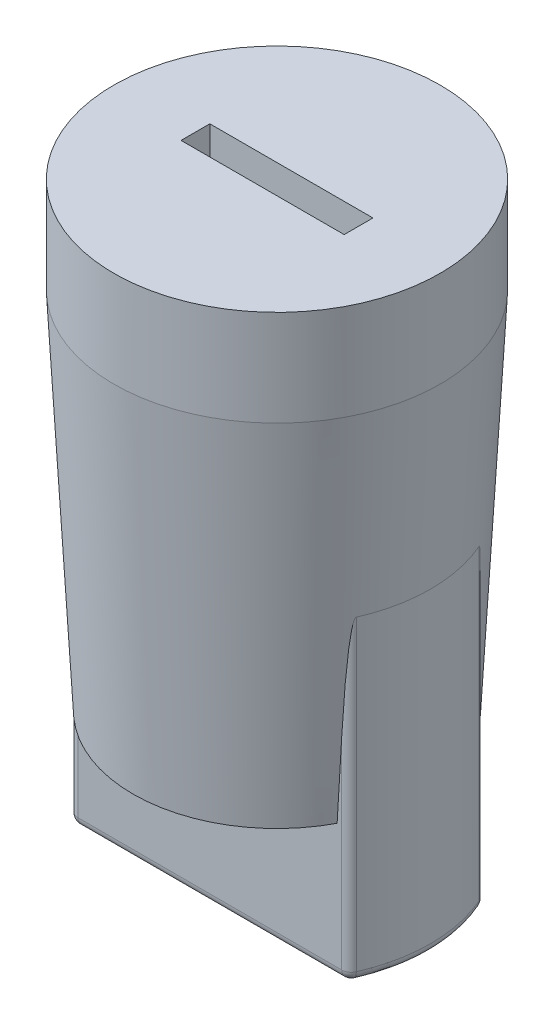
ISO-10303-21;
HEADER;
FILE_DESCRIPTION(('STEP AP214'),'2;1');
FILE_NAME('part.step','',(''),(''),'','','');
FILE_SCHEMA(('AUTOMOTIVE_DESIGN { 1 0 10303 214 1 1 1 1 }'));
ENDSEC;
DATA;
#1=APPLICATION_CONTEXT('core data for automotive mechanical design processes');
#2=APPLICATION_PROTOCOL_DEFINITION('international standard','automotive_design',2000,#1);
#3=PRODUCT_CONTEXT('',#1,'mechanical');
#4=PRODUCT('Part','Part','',(#3));
#5=PRODUCT_RELATED_PRODUCT_CATEGORY('part','',(#4));
#6=PRODUCT_DEFINITION_FORMATION('','',#4);
#7=PRODUCT_DEFINITION_CONTEXT('part definition',#1,'design');
#8=PRODUCT_DEFINITION('design','',#6,#7);
#9=PRODUCT_DEFINITION_SHAPE('','',#8);
#10=(LENGTH_UNIT() NAMED_UNIT(*) SI_UNIT(.MILLI.,.METRE.));
#11=(NAMED_UNIT(*) PLANE_ANGLE_UNIT() SI_UNIT($,.RADIAN.));
#12=(NAMED_UNIT(*) SI_UNIT($,.STERADIAN.) SOLID_ANGLE_UNIT());
#13=UNCERTAINTY_MEASURE_WITH_UNIT(LENGTH_MEASURE(1.E-05),#10,'distance_accuracy_value','');
#14=(GEOMETRIC_REPRESENTATION_CONTEXT(3) GLOBAL_UNCERTAINTY_ASSIGNED_CONTEXT((#13)) GLOBAL_UNIT_ASSIGNED_CONTEXT((#10,
#11,#12)) REPRESENTATION_CONTEXT('',''));
#15=CARTESIAN_POINT('',(0.,0.,0.));
#16=DIRECTION('',(0.,0.,1.));
#17=DIRECTION('',(1.,0.,0.));
#18=AXIS2_PLACEMENT_3D('',#15,#16,#17);
#19=CARTESIAN_POINT('',(7.5,0.,0.));
#20=DIRECTION('',(0.,-1.,0.));
#21=DIRECTION('',(0.,0.,-1.));
#22=AXIS2_PLACEMENT_3D('',#19,#20,#21);
#23=PLANE('',#22);
#24=DIRECTION('',(1.,0.,0.));
#25=VECTOR('',#24,1.);
#26=CARTESIAN_POINT('',(-7.19374728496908,0.,3.5));
#27=LINE('',#26,#25);
#28=CARTESIAN_POINT('',(-6.6332495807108,0.,3.5));
#29=VERTEX_POINT('',#28);
#30=CARTESIAN_POINT('',(6.6332495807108,0.,3.5));
#31=VERTEX_POINT('',#30);
#32=EDGE_CURVE('E251',#29,#31,#27,.T.);
#33=ORIENTED_EDGE('',*,*,#32,.T.);
#34=CARTESIAN_POINT('',(0.,0.,0.));
#35=DIRECTION('',(0.,-1.,0.));
#36=DIRECTION('',(0.,0.,-1.));
#37=AXIS2_PLACEMENT_3D('',#34,#35,#36);
#38=CIRCLE('',#37,7.5);
#39=EDGE_CURVE('E327',#31,#29,#38,.T.);
#40=ORIENTED_EDGE('',*,*,#39,.T.);
#41=EDGE_LOOP('',(#33,#40));
#42=FACE_BOUND('',#41,.T.);
#43=ADVANCED_FACE('F32',(#42),#23,.T.);
#44=CARTESIAN_POINT('',(0.,24.,0.));
#45=DIRECTION('',(0.,1.,0.));
#46=DIRECTION('',(0.,0.,1.));
#47=AXIS2_PLACEMENT_3D('',#44,#45,#46);
#48=PLANE('',#47);
#49=DIRECTION('',(-1.,0.,0.));
#50=VECTOR('',#49,1.);
#51=CARTESIAN_POINT('',(4.25,24.,0.750000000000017));
#52=LINE('',#51,#50);
#53=CARTESIAN_POINT('',(4.25,24.,0.750000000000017));
#54=VERTEX_POINT('',#53);
#55=CARTESIAN_POINT('',(-4.25000000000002,24.,0.750000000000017));
#56=VERTEX_POINT('',#55);
#57=EDGE_CURVE('E169',#54,#56,#52,.T.);
#58=ORIENTED_EDGE('',*,*,#57,.T.);
#59=DIRECTION('',(0.,0.,-1.));
#60=VECTOR('',#59,1.);
#61=CARTESIAN_POINT('',(-4.25000000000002,24.,0.750000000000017));
#62=LINE('',#61,#60);
#63=CARTESIAN_POINT('',(-4.25000000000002,24.,-0.749999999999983));
#64=VERTEX_POINT('',#63);
#65=EDGE_CURVE('E175',#56,#64,#62,.T.);
#66=ORIENTED_EDGE('',*,*,#65,.T.);
#67=DIRECTION('',(1.,0.,0.));
#68=VECTOR('',#67,1.);
#69=CARTESIAN_POINT('',(-4.25000000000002,24.,-0.749999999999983));
#70=LINE('',#69,#68);
#71=CARTESIAN_POINT('',(4.25,24.,-0.749999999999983));
#72=VERTEX_POINT('',#71);
#73=EDGE_CURVE('E52',#64,#72,#70,.T.);
#74=ORIENTED_EDGE('',*,*,#73,.T.);
#75=DIRECTION('',(0.,0.,1.));
#76=VECTOR('',#75,1.);
#77=CARTESIAN_POINT('',(4.25,24.,-0.749999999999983));
#78=LINE('',#77,#76);
#79=EDGE_CURVE('E178',#72,#54,#78,.T.);
#80=ORIENTED_EDGE('',*,*,#79,.T.);
#81=EDGE_LOOP('',(#58,#66,#74,#80));
#82=FACE_BOUND('',#81,.T.);
#83=CARTESIAN_POINT('',(0.,24.,0.));
#84=DIRECTION('',(0.,-1.,0.));
#85=DIRECTION('',(0.,0.,-1.));
#86=AXIS2_PLACEMENT_3D('',#83,#84,#85);
#87=CIRCLE('',#86,8.5);
#88=CARTESIAN_POINT('',(0.,24.,-8.5));
#89=VERTEX_POINT('',#88);
#90=EDGE_CURVE('E387',#89,#89,#87,.T.);
#91=ORIENTED_EDGE('',*,*,#90,.F.);
#92=EDGE_LOOP('',(#91));
#93=FACE_BOUND('',#92,.T.);
#94=ADVANCED_FACE('F34',(#82,#93),#48,.T.);
#95=CARTESIAN_POINT('',(0.,0.,0.));
#96=DIRECTION('',(0.,-1.,0.));
#97=DIRECTION('',(0.,0.,-1.));
#98=AXIS2_PLACEMENT_3D('',#95,#96,#97);
#99=CYLINDRICAL_SURFACE('',#98,8.5);
#100=ORIENTED_EDGE('',*,*,#90,.T.);
#101=EDGE_LOOP('',(#100));
#102=FACE_BOUND('',#101,.T.);
#103=CARTESIAN_POINT('',(0.,19.,0.));
#104=DIRECTION('',(0.,-1.,0.));
#105=DIRECTION('',(0.,0.,-1.));
#106=AXIS2_PLACEMENT_3D('',#103,#104,#105);
#107=CIRCLE('',#106,8.5);
#108=CARTESIAN_POINT('',(0.,19.,-8.5));
#109=VERTEX_POINT('',#108);
#110=EDGE_CURVE('E333',#109,#109,#107,.T.);
#111=ORIENTED_EDGE('',*,*,#110,.F.);
#112=EDGE_LOOP('',(#111));
#113=FACE_BOUND('',#112,.T.);
#114=ADVANCED_FACE('F280',(#102,#113),#99,.T.);
#115=CARTESIAN_POINT('',(0.,0.,0.));
#116=DIRECTION('',(0.,1.,0.));
#117=DIRECTION('',(0.,0.,1.));
#118=AXIS2_PLACEMENT_3D('',#115,#116,#117);
#119=CONICAL_SURFACE('',#118,7.5,0.0525830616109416);
#120=CARTESIAN_POINT('',(0.,9.5,0.));
#121=DIRECTION('',(0.,1.,0.));
#122=DIRECTION('',(0.,0.,1.));
#123=AXIS2_PLACEMENT_3D('',#120,#121,#122);
#124=CIRCLE('',#123,8.);
#125=CARTESIAN_POINT('',(-7.33212111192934,9.5,-3.2));
#126=VERTEX_POINT('',#125);
#127=CARTESIAN_POINT('',(-7.33212111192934,9.5,3.2));
#128=VERTEX_POINT('',#127);
#129=EDGE_CURVE('E231',#126,#128,#124,.T.);
#130=ORIENTED_EDGE('',*,*,#129,.T.);
#131=CARTESIAN_POINT('',(-7.33212111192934,9.5,3.2));
#132=CARTESIAN_POINT('',(-7.33141494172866,9.50000549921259,3.20161881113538));
#133=CARTESIAN_POINT('',(-7.33070275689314,9.49983355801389,3.20322649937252));
#134=CARTESIAN_POINT('',(-7.32929504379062,9.49918730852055,3.20636127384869));
#135=CARTESIAN_POINT('',(-7.32859942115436,9.49871719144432,3.20788916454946));
#136=CARTESIAN_POINT('',(-7.32701916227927,9.4973378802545,3.21131640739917));
#137=CARTESIAN_POINT('',(-7.32614353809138,9.49633729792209,3.21318228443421));
#138=CARTESIAN_POINT('',(-7.32444600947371,9.49402446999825,3.21674721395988));
#139=CARTESIAN_POINT('',(-7.32362447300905,9.49271032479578,3.21844515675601));
#140=CARTESIAN_POINT('',(-7.32136810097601,9.48867610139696,3.22304898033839));
#141=CARTESIAN_POINT('',(-7.32000083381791,9.48570551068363,3.22576489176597));
#142=CARTESIAN_POINT('',(-7.31741813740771,9.47939170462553,3.23079654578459));
#143=CARTESIAN_POINT('',(-7.31620310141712,9.47604756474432,3.23311125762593));
#144=CARTESIAN_POINT('',(-7.31009974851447,9.45801873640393,3.24456589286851));
#145=CARTESIAN_POINT('',(-7.30607629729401,9.44172398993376,3.2514985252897));
#146=CARTESIAN_POINT('',(-7.29868418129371,9.40840672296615,3.26376217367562));
#147=CARTESIAN_POINT('',(-7.29532275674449,9.39137839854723,3.26907579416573));
#148=CARTESIAN_POINT('',(-7.28593885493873,9.34038774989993,3.28342636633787));
#149=CARTESIAN_POINT('',(-7.28047295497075,9.30591738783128,3.29111797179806));
#150=CARTESIAN_POINT('',(-7.27020298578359,9.23656170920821,3.30492993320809));
#151=CARTESIAN_POINT('',(-7.26540036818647,9.2016756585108,3.31104686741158));
#152=CARTESIAN_POINT('',(-7.25625096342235,9.13184371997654,3.32223130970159));
#153=CARTESIAN_POINT('',(-7.25190205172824,9.09689896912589,3.32730382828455));
#154=CARTESIAN_POINT('',(-7.24350118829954,9.02692269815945,3.33675969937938));
#155=CARTESIAN_POINT('',(-7.2394489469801,8.99189129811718,3.34114372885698));
#156=CARTESIAN_POINT('',(-7.22764698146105,8.88694655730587,3.35350897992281));
#157=CARTESIAN_POINT('',(-7.22021768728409,8.81690879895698,3.36074366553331));
#158=CARTESIAN_POINT('',(-7.2059036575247,8.67665758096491,3.37395438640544));
#159=CARTESIAN_POINT('',(-7.19901898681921,8.60644410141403,3.37993027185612));
#160=CARTESIAN_POINT('',(-7.1789382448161,8.39555102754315,3.39652969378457));
#161=CARTESIAN_POINT('',(-7.16632529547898,8.25471122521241,3.40581534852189));
#162=CARTESIAN_POINT('',(-7.14202428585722,7.97255436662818,3.42225614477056));
#163=CARTESIAN_POINT('',(-7.13033811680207,7.83123691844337,3.42940700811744));
#164=CARTESIAN_POINT('',(-7.107659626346,7.54852218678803,3.44216323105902));
#165=CARTESIAN_POINT('',(-7.09666708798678,7.40712494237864,3.44776907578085));
#166=CARTESIAN_POINT('',(-7.06562861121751,6.99801511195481,3.46231226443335));
#167=CARTESIAN_POINT('',(-7.04625887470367,6.73019916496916,3.46975748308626));
#168=CARTESIAN_POINT('',(-7.00882075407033,6.1943729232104,3.48183823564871));
#169=CARTESIAN_POINT('',(-6.99075259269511,5.92636260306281,3.48647328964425));
#170=CARTESIAN_POINT('',(-6.95573504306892,5.39177296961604,3.49357478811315));
#171=CARTESIAN_POINT('',(-6.93877987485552,5.12519418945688,3.49605341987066));
#172=CARTESIAN_POINT('',(-6.90572266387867,4.59203663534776,3.49925282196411));
#173=CARTESIAN_POINT('',(-6.88962041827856,4.32545787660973,3.49997401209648));
#174=CARTESIAN_POINT('',(-6.87386354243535,4.05886189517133,3.5));
#175=B_SPLINE_CURVE_WITH_KNOTS('',3,(#131,#132,#133,#134,#135,#136,#137,#138,#139,#140,#141,
#142,#143,#144,#145,#146,#147,#148,#149,#150,#151,#152,#153,#154,#155,#156,#157,#158,#159,#160,
#161,#162,#163,#164,#165,#166,#167,#168,#169,#170,#171,#172,#173,#174),.UNSPECIFIED.,.F.,.F.,(4,
2,2,2,2,2,2,2,2,2,2,2,2,2,2,2,2,2,2,2,2,4),(0.,0.00527748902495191,0.0104823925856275,
0.0173169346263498,0.024193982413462,0.0368751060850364,0.0495883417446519,0.103526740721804,
0.158025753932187,0.265034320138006,0.372273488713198,0.478985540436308,0.585592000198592,
0.797968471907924,1.01037020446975,1.4354539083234,1.86138385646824,2.28717991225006,
3.09300645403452,3.89897057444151,4.70034953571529,5.50153705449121),.UNSPECIFIED.);
#176=CARTESIAN_POINT('',(-6.87386354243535,4.05886189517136,3.5));
#177=VERTEX_POINT('',#176);
#178=EDGE_CURVE('E285',#128,#177,#175,.T.);
#179=ORIENTED_EDGE('',*,*,#178,.T.);
#180=CARTESIAN_POINT('',(-5.89967308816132,-12.1647881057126,3.5));
#181=CARTESIAN_POINT('',(-6.04705887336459,-9.75597407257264,3.5));
#182=CARTESIAN_POINT('',(-6.19306293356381,-7.34707598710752,3.5));
#183=CARTESIAN_POINT('',(-6.48274733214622,-2.52914120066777,3.5));
#184=CARTESIAN_POINT('',(-6.62642767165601,-0.120104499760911,3.5));
#185=CARTESIAN_POINT('',(-6.91190447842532,4.698080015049,3.5));
#186=CARTESIAN_POINT('',(-7.05370094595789,7.1072278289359,3.5));
#187=CARTESIAN_POINT('',(-7.33571599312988,11.9256165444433,3.5));
#188=CARTESIAN_POINT('',(-7.47593457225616,14.3348574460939,3.5));
#189=CARTESIAN_POINT('',(-7.83341477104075,20.5063672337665,3.5));
#190=CARTESIAN_POINT('',(-8.04972292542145,24.2686913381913,3.5));
#191=CARTESIAN_POINT('',(-8.47981142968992,31.7934843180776,3.5));
#192=CARTESIAN_POINT('',(-8.69359177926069,35.5559531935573,3.5));
#193=CARTESIAN_POINT('',(-9.11913312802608,43.0810001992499,3.5));
#194=CARTESIAN_POINT('',(-9.33089412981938,46.843578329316,3.5));
#195=CARTESIAN_POINT('',(-9.75275478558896,54.3688266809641,3.5));
#196=CARTESIAN_POINT('',(-9.96285444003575,58.1314969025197,3.5));
#197=CARTESIAN_POINT('',(-10.1723023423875,61.8942032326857,3.5));
#198=B_SPLINE_CURVE_WITH_KNOTS('',3,(#180,#181,#182,#183,#184,#185,#186,#187,#188,#189,#190,
#191,#192,#193,#194,#195,#196,#197),.UNSPECIFIED.,.F.,.F.,(4,2,2,2,2,2,2,2,4),(0.,
7.2399552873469,14.4799070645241,21.7198577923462,28.9598108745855,40.2654209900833,
51.5710325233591,62.8766295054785,74.1822232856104),.UNSPECIFIED.);
#199=EDGE_CURVE('E259',#177,#29,#198,.F.);
#200=ORIENTED_EDGE('',*,*,#199,.T.);
#201=ORIENTED_EDGE('',*,*,#39,.F.);
#202=CARTESIAN_POINT('',(5.89967308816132,-12.1647881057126,3.5));
#203=CARTESIAN_POINT('',(6.04705887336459,-9.75597407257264,3.5));
#204=CARTESIAN_POINT('',(6.19306293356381,-7.34707598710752,3.5));
#205=CARTESIAN_POINT('',(6.48274733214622,-2.52914120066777,3.5));
#206=CARTESIAN_POINT('',(6.62642767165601,-0.120104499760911,3.5));
#207=CARTESIAN_POINT('',(6.91190447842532,4.698080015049,3.5));
#208=CARTESIAN_POINT('',(7.05370094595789,7.1072278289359,3.5));
#209=CARTESIAN_POINT('',(7.33571599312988,11.9256165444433,3.5));
#210=CARTESIAN_POINT('',(7.47593457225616,14.3348574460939,3.5));
#211=CARTESIAN_POINT('',(7.83341477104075,20.5063672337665,3.5));
#212=CARTESIAN_POINT('',(8.04972292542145,24.2686913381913,3.5));
#213=CARTESIAN_POINT('',(8.47981142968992,31.7934843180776,3.5));
#214=CARTESIAN_POINT('',(8.69359177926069,35.5559531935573,3.5));
#215=CARTESIAN_POINT('',(9.11913312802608,43.0810001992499,3.5));
#216=CARTESIAN_POINT('',(9.33089412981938,46.843578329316,3.5));
#217=CARTESIAN_POINT('',(9.75275478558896,54.3688266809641,3.5));
#218=CARTESIAN_POINT('',(9.96285444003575,58.1314969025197,3.5));
#219=CARTESIAN_POINT('',(10.1723023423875,61.8942032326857,3.5));
#220=B_SPLINE_CURVE_WITH_KNOTS('',3,(#202,#203,#204,#205,#206,#207,#208,#209,#210,#211,#212,
#213,#214,#215,#216,#217,#218,#219),.UNSPECIFIED.,.F.,.F.,(4,2,2,2,2,2,2,2,4),(0.,
7.2399552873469,14.4799070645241,21.7198577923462,28.9598108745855,40.2654209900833,
51.5710325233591,62.8766295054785,74.1822232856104),.UNSPECIFIED.);
#221=CARTESIAN_POINT('',(6.87386354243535,4.05886189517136,3.5));
#222=VERTEX_POINT('',#221);
#223=EDGE_CURVE('E253',#31,#222,#220,.T.);
#224=ORIENTED_EDGE('',*,*,#223,.T.);
#225=CARTESIAN_POINT('',(6.87386354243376,4.05886189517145,3.5));
#226=CARTESIAN_POINT('',(6.87877214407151,4.14197119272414,3.49999989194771));
#227=CARTESIAN_POINT('',(6.88371624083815,4.22507839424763,3.49992773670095));
#228=CARTESIAN_POINT('',(6.89367910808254,4.39129727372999,3.49963206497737));
#229=CARTESIAN_POINT('',(6.89869788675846,4.47440895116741,3.4994085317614));
#230=CARTESIAN_POINT('',(6.9088218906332,4.64077782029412,3.49880228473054));
#231=CARTESIAN_POINT('',(6.91392725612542,4.7240350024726,3.49841928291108));
#232=CARTESIAN_POINT('',(6.9242191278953,4.89053424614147,3.49748450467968));
#233=CARTESIAN_POINT('',(6.92940562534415,4.97377630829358,3.4969327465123));
#234=CARTESIAN_POINT('',(6.95557940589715,5.3904423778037,3.49373116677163));
#235=CARTESIAN_POINT('',(6.9772036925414,5.72381997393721,3.4897598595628));
#236=CARTESIAN_POINT('',(7.01097481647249,6.22386360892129,3.48097239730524));
#237=CARTESIAN_POINT('',(7.02245859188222,6.39059981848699,3.47756979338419));
#238=CARTESIAN_POINT('',(7.04595665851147,6.72399254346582,3.46961503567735));
#239=CARTESIAN_POINT('',(7.05797090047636,6.89064906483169,3.46506298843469));
#240=CARTESIAN_POINT('',(7.08262401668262,7.22343617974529,3.45453195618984));
#241=CARTESIAN_POINT('',(7.09526118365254,7.38956701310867,3.4485567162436));
#242=CARTESIAN_POINT('',(7.12140708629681,7.72173534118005,3.43467267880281));
#243=CARTESIAN_POINT('',(7.13491611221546,7.88777278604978,3.42676323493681));
#244=CARTESIAN_POINT('',(7.16314470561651,8.21937710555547,3.40818152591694));
#245=CARTESIAN_POINT('',(7.17786258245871,8.38494431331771,3.39751307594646));
#246=CARTESIAN_POINT('',(7.20156491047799,8.63280034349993,3.37777365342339));
#247=CARTESIAN_POINT('',(7.2097342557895,8.71531503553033,3.37057342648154));
#248=CARTESIAN_POINT('',(7.22688681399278,8.88007022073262,3.35428868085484));
#249=CARTESIAN_POINT('',(7.23586983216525,8.96231077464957,3.34520461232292));
#250=CARTESIAN_POINT('',(7.24870666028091,9.07048015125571,3.33092788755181));
#251=CARTESIAN_POINT('',(7.25189672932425,9.09668972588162,3.32728698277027));
#252=CARTESIAN_POINT('',(7.25848281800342,9.14901123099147,3.31952150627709));
#253=CARTESIAN_POINT('',(7.26187883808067,9.17512316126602,3.31539693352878));
#254=CARTESIAN_POINT('',(7.27018516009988,9.23635641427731,3.30494200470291));
#255=CARTESIAN_POINT('',(7.27520826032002,9.27141957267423,3.29834582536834));
#256=CARTESIAN_POINT('',(7.28438211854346,9.3298007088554,3.28550927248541));
#257=CARTESIAN_POINT('',(7.28829487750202,9.35327395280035,3.27983508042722));
#258=CARTESIAN_POINT('',(7.29549863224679,9.39227495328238,3.26879857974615));
#259=CARTESIAN_POINT('',(7.29859460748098,9.4079666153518,3.26390570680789));
#260=CARTESIAN_POINT('',(7.30434662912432,9.4339611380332,3.25437268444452));
#261=CARTESIAN_POINT('',(7.30684301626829,9.44443091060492,3.25012160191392));
#262=CARTESIAN_POINT('',(7.31104284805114,9.45981817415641,3.24265754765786));
#263=CARTESIAN_POINT('',(7.31255942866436,9.46501002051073,3.23991112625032));
#264=CARTESIAN_POINT('',(7.31579997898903,9.4750088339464,3.23388915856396));
#265=CARTESIAN_POINT('',(7.31752313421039,9.47981719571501,3.23061567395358));
#266=CARTESIAN_POINT('',(7.32016227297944,9.48597792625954,3.22543322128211));
#267=CARTESIAN_POINT('',(7.32094569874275,9.48767924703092,3.22387692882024));
#268=CARTESIAN_POINT('',(7.32257478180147,9.49088236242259,3.22059375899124));
#269=CARTESIAN_POINT('',(7.32342046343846,9.49238407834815,3.21886681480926));
#270=CARTESIAN_POINT('',(7.32504128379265,9.4948778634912,3.2155030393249));
#271=CARTESIAN_POINT('',(7.32580691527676,9.49591287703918,3.21389401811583));
#272=CARTESIAN_POINT('',(7.3273788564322,9.49768092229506,3.21054038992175));
#273=CARTESIAN_POINT('',(7.32818496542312,9.49841530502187,3.20879643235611));
#274=CARTESIAN_POINT('',(7.32951701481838,9.4992933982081,3.20586756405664));
#275=CARTESIAN_POINT('',(7.33003614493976,9.49955513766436,3.20471482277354));
#276=CARTESIAN_POINT('',(7.33107853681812,9.49990992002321,3.20237619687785));
#277=CARTESIAN_POINT('',(7.33160180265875,9.50000180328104,3.20119014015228));
#278=CARTESIAN_POINT('',(7.33212111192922,9.50000000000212,3.20000000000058));
#279=B_SPLINE_CURVE_WITH_KNOTS('',3,(#225,#226,#227,#228,#229,#230,#231,#232,#233,#234,#235,
#236,#237,#238,#239,#240,#241,#242,#243,#244,#245,#246,#247,#248,#249,#250,#251,#252,#253,#254,
#255,#256,#257,#258,#259,#260,#261,#262,#263,#264,#265,#266,#267,#268,#269,#270,#271,#272,#273,
#274,#275,#276,#277,#278),.UNSPECIFIED.,.F.,.F.,(4,2,2,2,2,2,2,2,2,2,2,2,2,2,2,2,2,2,2,2,2,2,2,
2,2,2,4),(0.,0.249762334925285,0.499552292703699,0.749795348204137,1.00001135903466,
2.00229177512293,2.50378578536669,3.00523332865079,3.50537564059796,4.00568531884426,
4.50530682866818,4.7549869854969,5.00460754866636,5.08456170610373,5.16451603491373,
5.27256385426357,5.34590832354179,5.39604485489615,5.43068952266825,5.44887217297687,
5.46698535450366,5.47428074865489,5.481579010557,5.48774133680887,5.49387565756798,
5.49773802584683,5.50162666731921),.UNSPECIFIED.);
#280=CARTESIAN_POINT('',(7.33212111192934,9.5,3.2));
#281=VERTEX_POINT('',#280);
#282=EDGE_CURVE('E45',#222,#281,#279,.T.);
#283=ORIENTED_EDGE('',*,*,#282,.T.);
#284=CARTESIAN_POINT('',(0.,9.5,0.));
#285=DIRECTION('',(0.,1.,0.));
#286=DIRECTION('',(0.,0.,1.));
#287=AXIS2_PLACEMENT_3D('',#284,#285,#286);
#288=CIRCLE('',#287,8.);
#289=CARTESIAN_POINT('',(7.33212111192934,9.5,-3.2));
#290=VERTEX_POINT('',#289);
#291=EDGE_CURVE('E221',#281,#290,#288,.T.);
#292=ORIENTED_EDGE('',*,*,#291,.T.);
#293=CARTESIAN_POINT('',(7.33212111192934,9.5,-3.2));
#294=CARTESIAN_POINT('',(7.33141494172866,9.50000549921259,-3.20161881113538));
#295=CARTESIAN_POINT('',(7.33070275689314,9.49983355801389,-3.20322649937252));
#296=CARTESIAN_POINT('',(7.32929504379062,9.49918730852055,-3.20636127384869));
#297=CARTESIAN_POINT('',(7.32859942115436,9.49871719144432,-3.20788916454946));
#298=CARTESIAN_POINT('',(7.32701916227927,9.4973378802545,-3.21131640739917));
#299=CARTESIAN_POINT('',(7.32614353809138,9.49633729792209,-3.21318228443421));
#300=CARTESIAN_POINT('',(7.32444600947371,9.49402446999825,-3.21674721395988));
#301=CARTESIAN_POINT('',(7.32362447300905,9.49271032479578,-3.21844515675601));
#302=CARTESIAN_POINT('',(7.32136810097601,9.48867610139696,-3.22304898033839));
#303=CARTESIAN_POINT('',(7.32000083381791,9.48570551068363,-3.22576489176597));
#304=CARTESIAN_POINT('',(7.31741813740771,9.47939170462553,-3.23079654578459));
#305=CARTESIAN_POINT('',(7.31620310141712,9.47604756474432,-3.23311125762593));
#306=CARTESIAN_POINT('',(7.31009974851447,9.45801873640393,-3.24456589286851));
#307=CARTESIAN_POINT('',(7.30607629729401,9.44172398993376,-3.2514985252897));
#308=CARTESIAN_POINT('',(7.29868418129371,9.40840672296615,-3.26376217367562));
#309=CARTESIAN_POINT('',(7.29532275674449,9.39137839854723,-3.26907579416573));
#310=CARTESIAN_POINT('',(7.28593885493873,9.34038774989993,-3.28342636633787));
#311=CARTESIAN_POINT('',(7.28047295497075,9.30591738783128,-3.29111797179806));
#312=CARTESIAN_POINT('',(7.27020298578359,9.23656170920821,-3.30492993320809));
#313=CARTESIAN_POINT('',(7.26540036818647,9.2016756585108,-3.31104686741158));
#314=CARTESIAN_POINT('',(7.25625096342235,9.13184371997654,-3.32223130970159));
#315=CARTESIAN_POINT('',(7.25190205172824,9.09689896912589,-3.32730382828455));
#316=CARTESIAN_POINT('',(7.24350118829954,9.02692269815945,-3.33675969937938));
#317=CARTESIAN_POINT('',(7.2394489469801,8.99189129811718,-3.34114372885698));
#318=CARTESIAN_POINT('',(7.22764698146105,8.88694655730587,-3.35350897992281));
#319=CARTESIAN_POINT('',(7.22021768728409,8.81690879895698,-3.36074366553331));
#320=CARTESIAN_POINT('',(7.2059036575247,8.67665758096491,-3.37395438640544));
#321=CARTESIAN_POINT('',(7.19901898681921,8.60644410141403,-3.37993027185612));
#322=CARTESIAN_POINT('',(7.1789382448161,8.39555102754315,-3.39652969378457));
#323=CARTESIAN_POINT('',(7.16632529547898,8.25471122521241,-3.40581534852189));
#324=CARTESIAN_POINT('',(7.14202428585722,7.97255436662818,-3.42225614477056));
#325=CARTESIAN_POINT('',(7.13033811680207,7.83123691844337,-3.42940700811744));
#326=CARTESIAN_POINT('',(7.107659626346,7.54852218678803,-3.44216323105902));
#327=CARTESIAN_POINT('',(7.09666708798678,7.40712494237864,-3.44776907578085));
#328=CARTESIAN_POINT('',(7.06562861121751,6.99801511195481,-3.46231226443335));
#329=CARTESIAN_POINT('',(7.04625887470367,6.73019916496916,-3.46975748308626));
#330=CARTESIAN_POINT('',(7.00882075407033,6.1943729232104,-3.48183823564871));
#331=CARTESIAN_POINT('',(6.99075259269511,5.92636260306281,-3.48647328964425));
#332=CARTESIAN_POINT('',(6.95573504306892,5.39177296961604,-3.49357478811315));
#333=CARTESIAN_POINT('',(6.93877987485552,5.12519418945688,-3.49605341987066));
#334=CARTESIAN_POINT('',(6.90572266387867,4.59203663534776,-3.49925282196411));
#335=CARTESIAN_POINT('',(6.88962041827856,4.32545787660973,-3.49997401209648));
#336=CARTESIAN_POINT('',(6.87386354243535,4.05886189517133,-3.5));
#337=B_SPLINE_CURVE_WITH_KNOTS('',3,(#293,#294,#295,#296,#297,#298,#299,#300,#301,#302,#303,
#304,#305,#306,#307,#308,#309,#310,#311,#312,#313,#314,#315,#316,#317,#318,#319,#320,#321,#322,
#323,#324,#325,#326,#327,#328,#329,#330,#331,#332,#333,#334,#335,#336),.UNSPECIFIED.,.F.,.F.,(4,
2,2,2,2,2,2,2,2,2,2,2,2,2,2,2,2,2,2,2,2,4),(0.,0.00527748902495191,0.0104823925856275,
0.0173169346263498,0.024193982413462,0.0368751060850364,0.0495883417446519,0.103526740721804,
0.158025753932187,0.265034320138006,0.372273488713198,0.478985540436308,0.585592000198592,
0.797968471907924,1.01037020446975,1.4354539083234,1.86138385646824,2.28717991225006,
3.09300645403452,3.89897057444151,4.70034953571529,5.50153705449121),.UNSPECIFIED.);
#338=CARTESIAN_POINT('',(6.87386354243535,4.05886189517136,-3.5));
#339=VERTEX_POINT('',#338);
#340=EDGE_CURVE('E11',#290,#339,#337,.T.);
#341=ORIENTED_EDGE('',*,*,#340,.T.);
#342=CARTESIAN_POINT('',(5.89967308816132,-12.1647881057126,-3.5));
#343=CARTESIAN_POINT('',(6.04705887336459,-9.75597407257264,-3.5));
#344=CARTESIAN_POINT('',(6.19306293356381,-7.34707598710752,-3.5));
#345=CARTESIAN_POINT('',(6.48274733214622,-2.52914120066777,-3.5));
#346=CARTESIAN_POINT('',(6.62642767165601,-0.120104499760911,-3.5));
#347=CARTESIAN_POINT('',(6.91190447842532,4.698080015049,-3.5));
#348=CARTESIAN_POINT('',(7.05370094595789,7.1072278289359,-3.5));
#349=CARTESIAN_POINT('',(7.33571599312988,11.9256165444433,-3.5));
#350=CARTESIAN_POINT('',(7.47593457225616,14.3348574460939,-3.5));
#351=CARTESIAN_POINT('',(7.83341477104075,20.5063672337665,-3.5));
#352=CARTESIAN_POINT('',(8.04972292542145,24.2686913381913,-3.5));
#353=CARTESIAN_POINT('',(8.47981142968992,31.7934843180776,-3.5));
#354=CARTESIAN_POINT('',(8.69359177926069,35.5559531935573,-3.5));
#355=CARTESIAN_POINT('',(9.11913312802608,43.0810001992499,-3.5));
#356=CARTESIAN_POINT('',(9.33089412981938,46.843578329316,-3.5));
#357=CARTESIAN_POINT('',(9.75275478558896,54.3688266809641,-3.5));
#358=CARTESIAN_POINT('',(9.96285444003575,58.1314969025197,-3.5));
#359=CARTESIAN_POINT('',(10.1723023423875,61.8942032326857,-3.5));
#360=B_SPLINE_CURVE_WITH_KNOTS('',3,(#342,#343,#344,#345,#346,#347,#348,#349,#350,#351,#352,
#353,#354,#355,#356,#357,#358,#359),.UNSPECIFIED.,.F.,.F.,(4,2,2,2,2,2,2,2,4),(0.,
7.2399552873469,14.4799070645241,21.7198577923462,28.9598108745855,40.2654209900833,
51.5710325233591,62.8766295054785,74.1822232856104),.UNSPECIFIED.);
#361=CARTESIAN_POINT('',(6.6332495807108,0.,-3.5));
#362=VERTEX_POINT('',#361);
#363=EDGE_CURVE('E224',#339,#362,#360,.F.);
#364=ORIENTED_EDGE('',*,*,#363,.T.);
#365=CARTESIAN_POINT('',(-6.6332495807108,0.,-3.5));
#366=VERTEX_POINT('',#365);
#367=EDGE_CURVE('E334',#366,#362,#38,.T.);
#368=ORIENTED_EDGE('',*,*,#367,.F.);
#369=CARTESIAN_POINT('',(-5.89967308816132,-12.1647881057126,-3.5));
#370=CARTESIAN_POINT('',(-6.04705887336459,-9.75597407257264,-3.5));
#371=CARTESIAN_POINT('',(-6.19306293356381,-7.34707598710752,-3.5));
#372=CARTESIAN_POINT('',(-6.48274733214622,-2.52914120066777,-3.5));
#373=CARTESIAN_POINT('',(-6.62642767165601,-0.120104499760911,-3.5));
#374=CARTESIAN_POINT('',(-6.91190447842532,4.698080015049,-3.5));
#375=CARTESIAN_POINT('',(-7.05370094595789,7.1072278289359,-3.5));
#376=CARTESIAN_POINT('',(-7.33571599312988,11.9256165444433,-3.5));
#377=CARTESIAN_POINT('',(-7.47593457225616,14.3348574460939,-3.5));
#378=CARTESIAN_POINT('',(-7.83341477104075,20.5063672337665,-3.5));
#379=CARTESIAN_POINT('',(-8.04972292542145,24.2686913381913,-3.5));
#380=CARTESIAN_POINT('',(-8.47981142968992,31.7934843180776,-3.5));
#381=CARTESIAN_POINT('',(-8.69359177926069,35.5559531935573,-3.5));
#382=CARTESIAN_POINT('',(-9.11913312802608,43.0810001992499,-3.5));
#383=CARTESIAN_POINT('',(-9.33089412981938,46.843578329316,-3.5));
#384=CARTESIAN_POINT('',(-9.75275478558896,54.3688266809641,-3.5));
#385=CARTESIAN_POINT('',(-9.96285444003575,58.1314969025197,-3.5));
#386=CARTESIAN_POINT('',(-10.1723023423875,61.8942032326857,-3.5));
#387=B_SPLINE_CURVE_WITH_KNOTS('',3,(#369,#370,#371,#372,#373,#374,#375,#376,#377,#378,#379,
#380,#381,#382,#383,#384,#385,#386),.UNSPECIFIED.,.F.,.F.,(4,2,2,2,2,2,2,2,4),(0.,
7.2399552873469,14.4799070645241,21.7198577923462,28.9598108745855,40.2654209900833,
51.5710325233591,62.8766295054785,74.1822232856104),.UNSPECIFIED.);
#388=CARTESIAN_POINT('',(-6.87386354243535,4.05886189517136,-3.5));
#389=VERTEX_POINT('',#388);
#390=EDGE_CURVE('E245',#366,#389,#387,.T.);
#391=ORIENTED_EDGE('',*,*,#390,.T.);
#392=CARTESIAN_POINT('',(-6.87386354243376,4.05886189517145,-3.5));
#393=CARTESIAN_POINT('',(-6.87877214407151,4.14197119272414,-3.49999989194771));
#394=CARTESIAN_POINT('',(-6.88371624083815,4.22507839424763,-3.49992773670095));
#395=CARTESIAN_POINT('',(-6.89367910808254,4.39129727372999,-3.49963206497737));
#396=CARTESIAN_POINT('',(-6.89869788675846,4.47440895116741,-3.4994085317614));
#397=CARTESIAN_POINT('',(-6.9088218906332,4.64077782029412,-3.49880228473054));
#398=CARTESIAN_POINT('',(-6.91392725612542,4.7240350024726,-3.49841928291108));
#399=CARTESIAN_POINT('',(-6.9242191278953,4.89053424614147,-3.49748450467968));
#400=CARTESIAN_POINT('',(-6.92940562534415,4.97377630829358,-3.4969327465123));
#401=CARTESIAN_POINT('',(-6.95557940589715,5.3904423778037,-3.49373116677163));
#402=CARTESIAN_POINT('',(-6.9772036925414,5.72381997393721,-3.4897598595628));
#403=CARTESIAN_POINT('',(-7.01097481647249,6.22386360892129,-3.48097239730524));
#404=CARTESIAN_POINT('',(-7.02245859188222,6.39059981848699,-3.47756979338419));
#405=CARTESIAN_POINT('',(-7.04595665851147,6.72399254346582,-3.46961503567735));
#406=CARTESIAN_POINT('',(-7.05797090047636,6.89064906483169,-3.46506298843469));
#407=CARTESIAN_POINT('',(-7.08262401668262,7.22343617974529,-3.45453195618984));
#408=CARTESIAN_POINT('',(-7.09526118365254,7.38956701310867,-3.4485567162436));
#409=CARTESIAN_POINT('',(-7.12140708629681,7.72173534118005,-3.43467267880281));
#410=CARTESIAN_POINT('',(-7.13491611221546,7.88777278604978,-3.42676323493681));
#411=CARTESIAN_POINT('',(-7.16314470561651,8.21937710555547,-3.40818152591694));
#412=CARTESIAN_POINT('',(-7.17786258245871,8.38494431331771,-3.39751307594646));
#413=CARTESIAN_POINT('',(-7.20156491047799,8.63280034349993,-3.37777365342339));
#414=CARTESIAN_POINT('',(-7.2097342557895,8.71531503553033,-3.37057342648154));
#415=CARTESIAN_POINT('',(-7.22688681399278,8.88007022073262,-3.35428868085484));
#416=CARTESIAN_POINT('',(-7.23586983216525,8.96231077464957,-3.34520461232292));
#417=CARTESIAN_POINT('',(-7.24870666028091,9.07048015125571,-3.33092788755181));
#418=CARTESIAN_POINT('',(-7.25189672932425,9.09668972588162,-3.32728698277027));
#419=CARTESIAN_POINT('',(-7.25848281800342,9.14901123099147,-3.31952150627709));
#420=CARTESIAN_POINT('',(-7.26187883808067,9.17512316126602,-3.31539693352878));
#421=CARTESIAN_POINT('',(-7.27018516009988,9.23635641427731,-3.30494200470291));
#422=CARTESIAN_POINT('',(-7.27520826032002,9.27141957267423,-3.29834582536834));
#423=CARTESIAN_POINT('',(-7.28438211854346,9.3298007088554,-3.28550927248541));
#424=CARTESIAN_POINT('',(-7.28829487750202,9.35327395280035,-3.27983508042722));
#425=CARTESIAN_POINT('',(-7.29549863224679,9.39227495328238,-3.26879857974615));
#426=CARTESIAN_POINT('',(-7.29859460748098,9.4079666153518,-3.26390570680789));
#427=CARTESIAN_POINT('',(-7.30434662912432,9.4339611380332,-3.25437268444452));
#428=CARTESIAN_POINT('',(-7.30684301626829,9.44443091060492,-3.25012160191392));
#429=CARTESIAN_POINT('',(-7.31104284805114,9.45981817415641,-3.24265754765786));
#430=CARTESIAN_POINT('',(-7.31255942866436,9.46501002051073,-3.23991112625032));
#431=CARTESIAN_POINT('',(-7.31579997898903,9.4750088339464,-3.23388915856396));
#432=CARTESIAN_POINT('',(-7.31752313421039,9.47981719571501,-3.23061567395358));
#433=CARTESIAN_POINT('',(-7.32016227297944,9.48597792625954,-3.22543322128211));
#434=CARTESIAN_POINT('',(-7.32094569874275,9.48767924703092,-3.22387692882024));
#435=CARTESIAN_POINT('',(-7.32257478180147,9.49088236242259,-3.22059375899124));
#436=CARTESIAN_POINT('',(-7.32342046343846,9.49238407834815,-3.21886681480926));
#437=CARTESIAN_POINT('',(-7.32504128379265,9.4948778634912,-3.2155030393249));
#438=CARTESIAN_POINT('',(-7.32580691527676,9.49591287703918,-3.21389401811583));
#439=CARTESIAN_POINT('',(-7.3273788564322,9.49768092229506,-3.21054038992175));
#440=CARTESIAN_POINT('',(-7.32818496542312,9.49841530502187,-3.20879643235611));
#441=CARTESIAN_POINT('',(-7.32951701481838,9.4992933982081,-3.20586756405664));
#442=CARTESIAN_POINT('',(-7.33003614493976,9.49955513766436,-3.20471482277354));
#443=CARTESIAN_POINT('',(-7.33107853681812,9.49990992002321,-3.20237619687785));
#444=CARTESIAN_POINT('',(-7.33160180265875,9.50000180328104,-3.20119014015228));
#445=CARTESIAN_POINT('',(-7.33212111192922,9.50000000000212,-3.20000000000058));
#446=B_SPLINE_CURVE_WITH_KNOTS('',3,(#392,#393,#394,#395,#396,#397,#398,#399,#400,#401,#402,
#403,#404,#405,#406,#407,#408,#409,#410,#411,#412,#413,#414,#415,#416,#417,#418,#419,#420,#421,
#422,#423,#424,#425,#426,#427,#428,#429,#430,#431,#432,#433,#434,#435,#436,#437,#438,#439,#440,
#441,#442,#443,#444,#445),.UNSPECIFIED.,.F.,.F.,(4,2,2,2,2,2,2,2,2,2,2,2,2,2,2,2,2,2,2,2,2,2,2,
2,2,2,4),(0.,0.249762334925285,0.499552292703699,0.749795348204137,1.00001135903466,
2.00229177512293,2.50378578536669,3.00523332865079,3.50537564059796,4.00568531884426,
4.50530682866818,4.7549869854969,5.00460754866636,5.08456170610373,5.16451603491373,
5.27256385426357,5.34590832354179,5.39604485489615,5.43068952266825,5.44887217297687,
5.46698535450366,5.47428074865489,5.481579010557,5.48774133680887,5.49387565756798,
5.49773802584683,5.50162666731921),.UNSPECIFIED.);
#447=EDGE_CURVE('E292',#389,#126,#446,.T.);
#448=ORIENTED_EDGE('',*,*,#447,.T.);
#449=EDGE_LOOP('',(#130,#179,#200,#201,#224,#283,#292,#341,#364,#368,#391,#448));
#450=FACE_BOUND('',#449,.T.);
#451=ORIENTED_EDGE('',*,*,#110,.T.);
#452=EDGE_LOOP('',(#451));
#453=FACE_BOUND('',#452,.T.);
#454=ADVANCED_FACE('F276',(#450,#453),#119,.T.);
#455=DIRECTION('',(-1.,0.,0.));
#456=VECTOR('',#455,1.);
#457=CARTESIAN_POINT('',(-7.19374728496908,0.,-3.5));
#458=LINE('',#457,#456);
#459=EDGE_CURVE('E219',#362,#366,#458,.T.);
#460=ORIENTED_EDGE('',*,*,#459,.T.);
#461=ORIENTED_EDGE('',*,*,#367,.T.);
#462=EDGE_LOOP('',(#460,#461));
#463=FACE_BOUND('',#462,.T.);
#464=ADVANCED_FACE('F274',(#463),#23,.T.);
#465=CARTESIAN_POINT('',(0.,-7.,0.));
#466=DIRECTION('',(0.,-1.,0.));
#467=DIRECTION('',(0.,0.,-1.));
#468=AXIS2_PLACEMENT_3D('',#465,#466,#467);
#469=PLANE('',#468);
#470=DIRECTION('',(-1.,0.,0.));
#471=VECTOR('',#470,1.);
#472=CARTESIAN_POINT('',(4.25,-7.,0.750000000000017));
#473=LINE('',#472,#471);
#474=CARTESIAN_POINT('',(4.25,-7.,0.750000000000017));
#475=VERTEX_POINT('',#474);
#476=CARTESIAN_POINT('',(-4.25000000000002,-7.,0.750000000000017));
#477=VERTEX_POINT('',#476);
#478=EDGE_CURVE('E60',#475,#477,#473,.T.);
#479=ORIENTED_EDGE('',*,*,#478,.F.);
#480=DIRECTION('',(0.,0.,1.));
#481=VECTOR('',#480,1.);
#482=CARTESIAN_POINT('',(4.25,-7.,-0.749999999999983));
#483=LINE('',#482,#481);
#484=CARTESIAN_POINT('',(4.25,-7.,-0.749999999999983));
#485=VERTEX_POINT('',#484);
#486=EDGE_CURVE('E167',#485,#475,#483,.T.);
#487=ORIENTED_EDGE('',*,*,#486,.F.);
#488=DIRECTION('',(1.,0.,0.));
#489=VECTOR('',#488,1.);
#490=CARTESIAN_POINT('',(-4.25000000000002,-7.,-0.749999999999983));
#491=LINE('',#490,#489);
#492=CARTESIAN_POINT('',(-4.25000000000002,-7.,-0.749999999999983));
#493=VERTEX_POINT('',#492);
#494=EDGE_CURVE('E151',#493,#485,#491,.T.);
#495=ORIENTED_EDGE('',*,*,#494,.F.);
#496=DIRECTION('',(0.,0.,-1.));
#497=VECTOR('',#496,1.);
#498=CARTESIAN_POINT('',(-4.25000000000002,-7.,0.750000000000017));
#499=LINE('',#498,#497);
#500=EDGE_CURVE('E160',#477,#493,#499,.T.);
#501=ORIENTED_EDGE('',*,*,#500,.F.);
#502=EDGE_LOOP('',(#479,#487,#495,#501));
#503=FACE_BOUND('',#502,.T.);
#504=CARTESIAN_POINT('',(0.,-7.,0.));
#505=DIRECTION('',(0.,-1.,0.));
#506=DIRECTION('',(0.,0.,-1.));
#507=AXIS2_PLACEMENT_3D('',#504,#505,#506);
#508=CIRCLE('',#507,7.5);
#509=CARTESIAN_POINT('',(-6.87386354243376,-7.,3.));
#510=VERTEX_POINT('',#509);
#511=CARTESIAN_POINT('',(-6.87386354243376,-7.,-3.));
#512=VERTEX_POINT('',#511);
#513=EDGE_CURVE('E381',#510,#512,#508,.T.);
#514=ORIENTED_EDGE('',*,*,#513,.T.);
#515=DIRECTION('',(1.,0.,0.));
#516=VECTOR('',#515,1.);
#517=CARTESIAN_POINT('',(0.,-7.,-3.));
#518=LINE('',#517,#516);
#519=CARTESIAN_POINT('',(6.87386354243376,-7.,-3.));
#520=VERTEX_POINT('',#519);
#521=EDGE_CURVE('E378',#512,#520,#518,.T.);
#522=ORIENTED_EDGE('',*,*,#521,.T.);
#523=CARTESIAN_POINT('',(0.,-7.,0.));
#524=DIRECTION('',(0.,-1.,0.));
#525=DIRECTION('',(0.,0.,-1.));
#526=AXIS2_PLACEMENT_3D('',#523,#524,#525);
#527=CIRCLE('',#526,7.5);
#528=CARTESIAN_POINT('',(6.87386354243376,-7.,3.));
#529=VERTEX_POINT('',#528);
#530=EDGE_CURVE('E385',#520,#529,#527,.T.);
#531=ORIENTED_EDGE('',*,*,#530,.T.);
#532=DIRECTION('',(-1.,0.,0.));
#533=VECTOR('',#532,1.);
#534=CARTESIAN_POINT('',(0.,-7.,3.));
#535=LINE('',#534,#533);
#536=EDGE_CURVE('E383',#529,#510,#535,.T.);
#537=ORIENTED_EDGE('',*,*,#536,.T.);
#538=EDGE_LOOP('',(#514,#522,#531,#537));
#539=FACE_BOUND('',#538,.T.);
#540=ADVANCED_FACE('F164',(#503,#539),#469,.T.);
#541=CARTESIAN_POINT('',(-7.19374728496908,24.001,3.5));
#542=DIRECTION('',(0.,0.,1.));
#543=DIRECTION('',(1.,0.,0.));
#544=AXIS2_PLACEMENT_3D('',#541,#542,#543);
#545=PLANE('',#544);
#546=ORIENTED_EDGE('',*,*,#199,.F.);
#547=DIRECTION('',(0.,-1.,0.));
#548=VECTOR('',#547,1.);
#549=CARTESIAN_POINT('',(-6.87386354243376,24.001,3.5));
#550=LINE('',#549,#548);
#551=CARTESIAN_POINT('',(-6.87386354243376,-6.5,3.5));
#552=VERTEX_POINT('',#551);
#553=EDGE_CURVE('E343',#177,#552,#550,.T.);
#554=ORIENTED_EDGE('',*,*,#553,.T.);
#555=DIRECTION('',(-1.,0.,0.));
#556=VECTOR('',#555,1.);
#557=CARTESIAN_POINT('',(-7.19374728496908,-6.5,3.5));
#558=LINE('',#557,#556);
#559=CARTESIAN_POINT('',(6.87386354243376,-6.5,3.5));
#560=VERTEX_POINT('',#559);
#561=EDGE_CURVE('E338',#552,#560,#558,.F.);
#562=ORIENTED_EDGE('',*,*,#561,.T.);
#563=DIRECTION('',(0.,-1.,0.));
#564=VECTOR('',#563,1.);
#565=CARTESIAN_POINT('',(6.87386354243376,24.001,3.5));
#566=LINE('',#565,#564);
#567=EDGE_CURVE('E336',#560,#222,#566,.F.);
#568=ORIENTED_EDGE('',*,*,#567,.T.);
#569=ORIENTED_EDGE('',*,*,#223,.F.);
#570=ORIENTED_EDGE('',*,*,#32,.F.);
#571=EDGE_LOOP('',(#546,#554,#562,#568,#569,#570));
#572=FACE_BOUND('',#571,.T.);
#573=ADVANCED_FACE('F264',(#572),#545,.T.);
#574=CARTESIAN_POINT('',(0.,24.001,0.));
#575=DIRECTION('',(0.,-1.,0.));
#576=DIRECTION('',(0.,0.,-1.));
#577=AXIS2_PLACEMENT_3D('',#574,#575,#576);
#578=CYLINDRICAL_SURFACE('',#577,8.);
#579=CARTESIAN_POINT('',(0.,-6.5,0.));
#580=DIRECTION('',(0.,-1.,0.));
#581=DIRECTION('',(0.,0.,-1.));
#582=AXIS2_PLACEMENT_3D('',#579,#580,#581);
#583=CIRCLE('',#582,8.);
#584=CARTESIAN_POINT('',(-7.33212111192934,-6.5,-3.2));
#585=VERTEX_POINT('',#584);
#586=CARTESIAN_POINT('',(-7.33212111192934,-6.5,3.2));
#587=VERTEX_POINT('',#586);
#588=EDGE_CURVE('E345',#585,#587,#583,.F.);
#589=ORIENTED_EDGE('',*,*,#588,.T.);
#590=DIRECTION('',(0.,-1.,0.));
#591=VECTOR('',#590,1.);
#592=CARTESIAN_POINT('',(-7.33212111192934,24.001,3.2));
#593=LINE('',#592,#591);
#594=EDGE_CURVE('E341',#587,#128,#593,.F.);
#595=ORIENTED_EDGE('',*,*,#594,.T.);
#596=ORIENTED_EDGE('',*,*,#129,.F.);
#597=DIRECTION('',(0.,-1.,0.));
#598=VECTOR('',#597,1.);
#599=CARTESIAN_POINT('',(-7.33212111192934,24.001,-3.2));
#600=LINE('',#599,#598);
#601=EDGE_CURVE('E364',#126,#585,#600,.T.);
#602=ORIENTED_EDGE('',*,*,#601,.T.);
#603=EDGE_LOOP('',(#589,#595,#596,#602));
#604=FACE_BOUND('',#603,.T.);
#605=ADVANCED_FACE('F241',(#604),#578,.T.);
#606=CARTESIAN_POINT('',(-7.19374728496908,24.001,-3.5));
#607=DIRECTION('',(0.,0.,-1.));
#608=DIRECTION('',(-1.,0.,0.));
#609=AXIS2_PLACEMENT_3D('',#606,#607,#608);
#610=PLANE('',#609);
#611=DIRECTION('',(1.,0.,0.));
#612=VECTOR('',#611,1.);
#613=CARTESIAN_POINT('',(-7.19374728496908,-6.5,-3.5));
#614=LINE('',#613,#612);
#615=CARTESIAN_POINT('',(6.87386354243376,-6.5,-3.5));
#616=VERTEX_POINT('',#615);
#617=CARTESIAN_POINT('',(-6.87386354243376,-6.5,-3.5));
#618=VERTEX_POINT('',#617);
#619=EDGE_CURVE('E371',#616,#618,#614,.F.);
#620=ORIENTED_EDGE('',*,*,#619,.T.);
#621=DIRECTION('',(0.,-1.,0.));
#622=VECTOR('',#621,1.);
#623=CARTESIAN_POINT('',(-6.87386354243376,24.001,-3.5));
#624=LINE('',#623,#622);
#625=EDGE_CURVE('E369',#618,#389,#624,.F.);
#626=ORIENTED_EDGE('',*,*,#625,.T.);
#627=ORIENTED_EDGE('',*,*,#390,.F.);
#628=ORIENTED_EDGE('',*,*,#459,.F.);
#629=ORIENTED_EDGE('',*,*,#363,.F.);
#630=DIRECTION('',(0.,-1.,0.));
#631=VECTOR('',#630,1.);
#632=CARTESIAN_POINT('',(6.87386354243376,24.001,-3.5));
#633=LINE('',#632,#631);
#634=EDGE_CURVE('E376',#339,#616,#633,.T.);
#635=ORIENTED_EDGE('',*,*,#634,.T.);
#636=EDGE_LOOP('',(#620,#626,#627,#628,#629,#635));
#637=FACE_BOUND('',#636,.T.);
#638=ADVANCED_FACE('F236',(#637),#610,.T.);
#639=CARTESIAN_POINT('',(0.,24.001,0.));
#640=DIRECTION('',(0.,-1.,0.));
#641=DIRECTION('',(0.,0.,-1.));
#642=AXIS2_PLACEMENT_3D('',#639,#640,#641);
#643=CYLINDRICAL_SURFACE('',#642,8.);
#644=ORIENTED_EDGE('',*,*,#291,.F.);
#645=DIRECTION('',(0.,-1.,0.));
#646=VECTOR('',#645,1.);
#647=CARTESIAN_POINT('',(7.33212111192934,24.001,3.2));
#648=LINE('',#647,#646);
#649=CARTESIAN_POINT('',(7.33212111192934,-6.5,3.2));
#650=VERTEX_POINT('',#649);
#651=EDGE_CURVE('E353',#281,#650,#648,.T.);
#652=ORIENTED_EDGE('',*,*,#651,.T.);
#653=CARTESIAN_POINT('',(0.,-6.5,0.));
#654=DIRECTION('',(0.,-1.,0.));
#655=DIRECTION('',(0.,0.,-1.));
#656=AXIS2_PLACEMENT_3D('',#653,#654,#655);
#657=CIRCLE('',#656,8.);
#658=CARTESIAN_POINT('',(7.33212111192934,-6.5,-3.2));
#659=VERTEX_POINT('',#658);
#660=EDGE_CURVE('E352',#650,#659,#657,.F.);
#661=ORIENTED_EDGE('',*,*,#660,.T.);
#662=DIRECTION('',(0.,-1.,0.));
#663=VECTOR('',#662,1.);
#664=CARTESIAN_POINT('',(7.33212111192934,24.001,-3.2));
#665=LINE('',#664,#663);
#666=EDGE_CURVE('E350',#659,#290,#665,.F.);
#667=ORIENTED_EDGE('',*,*,#666,.T.);
#668=EDGE_LOOP('',(#644,#652,#661,#667));
#669=FACE_BOUND('',#668,.T.);
#670=ADVANCED_FACE('F240',(#669),#643,.T.);
#671=CARTESIAN_POINT('',(-6.87386354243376,24.001,3.));
#672=DIRECTION('',(0.,-1.,0.));
#673=DIRECTION('',(0.,0.,-1.));
#674=AXIS2_PLACEMENT_3D('',#671,#672,#673);
#675=CYLINDRICAL_SURFACE('',#674,0.5);
#676=ORIENTED_EDGE('',*,*,#178,.F.);
#677=ORIENTED_EDGE('',*,*,#594,.F.);
#678=CARTESIAN_POINT('',(-6.87386354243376,-6.5,3.));
#679=DIRECTION('',(0.,-1.,0.));
#680=DIRECTION('',(1.,0.,0.));
#681=AXIS2_PLACEMENT_3D('',#678,#679,#680);
#682=CIRCLE('',#681,0.5);
#683=EDGE_CURVE('E216',#552,#587,#682,.T.);
#684=ORIENTED_EDGE('',*,*,#683,.F.);
#685=ORIENTED_EDGE('',*,*,#553,.F.);
#686=EDGE_LOOP('',(#676,#677,#684,#685));
#687=FACE_BOUND('',#686,.T.);
#688=ADVANCED_FACE('F272',(#687),#675,.T.);
#689=CARTESIAN_POINT('',(0.,-6.5,3.));
#690=DIRECTION('',(-1.,0.,0.));
#691=DIRECTION('',(0.,0.,1.));
#692=AXIS2_PLACEMENT_3D('',#689,#690,#691);
#693=CYLINDRICAL_SURFACE('',#692,0.5);
#694=CARTESIAN_POINT('',(6.87386354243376,-6.5,3.));
#695=DIRECTION('',(1.,0.,0.));
#696=DIRECTION('',(0.,1.,0.));
#697=AXIS2_PLACEMENT_3D('',#694,#695,#696);
#698=CIRCLE('',#697,0.5);
#699=EDGE_CURVE('E210',#560,#529,#698,.T.);
#700=ORIENTED_EDGE('',*,*,#699,.F.);
#701=ORIENTED_EDGE('',*,*,#561,.F.);
#702=CARTESIAN_POINT('',(-6.87386354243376,-6.5,3.));
#703=DIRECTION('',(-1.,0.,0.));
#704=DIRECTION('',(0.,0.,1.));
#705=AXIS2_PLACEMENT_3D('',#702,#703,#704);
#706=CIRCLE('',#705,0.5);
#707=EDGE_CURVE('E213',#510,#552,#706,.T.);
#708=ORIENTED_EDGE('',*,*,#707,.F.);
#709=ORIENTED_EDGE('',*,*,#536,.F.);
#710=EDGE_LOOP('',(#700,#701,#708,#709));
#711=FACE_BOUND('',#710,.T.);
#712=ADVANCED_FACE('F307',(#711),#693,.T.);
#713=CARTESIAN_POINT('',(6.87386354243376,24.001,3.));
#714=DIRECTION('',(0.,-1.,0.));
#715=DIRECTION('',(0.,0.,-1.));
#716=AXIS2_PLACEMENT_3D('',#713,#714,#715);
#717=CYLINDRICAL_SURFACE('',#716,0.5);
#718=ORIENTED_EDGE('',*,*,#282,.F.);
#719=ORIENTED_EDGE('',*,*,#567,.F.);
#720=CARTESIAN_POINT('',(6.87386354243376,-6.5,3.));
#721=DIRECTION('',(0.,-1.,0.));
#722=DIRECTION('',(0.,0.,-1.));
#723=AXIS2_PLACEMENT_3D('',#720,#721,#722);
#724=CIRCLE('',#723,0.5);
#725=EDGE_CURVE('E207',#650,#560,#724,.T.);
#726=ORIENTED_EDGE('',*,*,#725,.F.);
#727=ORIENTED_EDGE('',*,*,#651,.F.);
#728=EDGE_LOOP('',(#718,#719,#726,#727));
#729=FACE_BOUND('',#728,.T.);
#730=ADVANCED_FACE('F301',(#729),#717,.T.);
#731=CARTESIAN_POINT('',(-6.87386354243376,-6.5,3.));
#732=DIRECTION('',(0.,0.,1.));
#733=DIRECTION('',(1.,0.,0.));
#734=AXIS2_PLACEMENT_3D('',#731,#732,#733);
#735=SPHERICAL_SURFACE('',#734,0.5);
#736=ORIENTED_EDGE('',*,*,#707,.T.);
#737=ORIENTED_EDGE('',*,*,#683,.T.);
#738=CARTESIAN_POINT('',(-6.87386354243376,-6.5,3.));
#739=DIRECTION('',(0.4,0.,0.916515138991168));
#740=DIRECTION('',(0.916515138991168,0.,-0.400000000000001));
#741=AXIS2_PLACEMENT_3D('',#738,#739,#740);
#742=CIRCLE('',#741,0.5);
#743=EDGE_CURVE('E204',#510,#587,#742,.F.);
#744=ORIENTED_EDGE('',*,*,#743,.F.);
#745=EDGE_LOOP('',(#736,#737,#744));
#746=FACE_BOUND('',#745,.T.);
#747=ADVANCED_FACE('F306',(#746),#735,.T.);
#748=CARTESIAN_POINT('',(6.87386354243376,-6.5,3.));
#749=DIRECTION('',(0.,0.,1.));
#750=DIRECTION('',(1.,0.,0.));
#751=AXIS2_PLACEMENT_3D('',#748,#749,#750);
#752=SPHERICAL_SURFACE('',#751,0.5);
#753=ORIENTED_EDGE('',*,*,#725,.T.);
#754=ORIENTED_EDGE('',*,*,#699,.T.);
#755=CARTESIAN_POINT('',(6.87386354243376,-6.5,3.));
#756=DIRECTION('',(-0.400000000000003,0.,0.916515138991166));
#757=DIRECTION('',(0.916515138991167,0.,0.400000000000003));
#758=AXIS2_PLACEMENT_3D('',#755,#756,#757);
#759=CIRCLE('',#758,0.5);
#760=EDGE_CURVE('E201',#650,#529,#759,.F.);
#761=ORIENTED_EDGE('',*,*,#760,.F.);
#762=EDGE_LOOP('',(#753,#754,#761));
#763=FACE_BOUND('',#762,.T.);
#764=ADVANCED_FACE('F435',(#763),#752,.T.);
#765=CARTESIAN_POINT('',(-6.87386354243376,24.001,-3.));
#766=DIRECTION('',(0.,-1.,0.));
#767=DIRECTION('',(0.,0.,-1.));
#768=AXIS2_PLACEMENT_3D('',#765,#766,#767);
#769=CYLINDRICAL_SURFACE('',#768,0.5);
#770=ORIENTED_EDGE('',*,*,#447,.F.);
#771=ORIENTED_EDGE('',*,*,#625,.F.);
#772=CARTESIAN_POINT('',(-6.87386354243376,-6.5,-3.));
#773=DIRECTION('',(0.,-1.,0.));
#774=DIRECTION('',(0.,0.,-1.));
#775=AXIS2_PLACEMENT_3D('',#772,#773,#774);
#776=CIRCLE('',#775,0.5);
#777=EDGE_CURVE('E198',#585,#618,#776,.T.);
#778=ORIENTED_EDGE('',*,*,#777,.F.);
#779=ORIENTED_EDGE('',*,*,#601,.F.);
#780=EDGE_LOOP('',(#770,#771,#778,#779));
#781=FACE_BOUND('',#780,.T.);
#782=ADVANCED_FACE('F368',(#781),#769,.T.);
#783=CARTESIAN_POINT('',(0.,-6.5,0.));
#784=DIRECTION('',(0.,-1.,0.));
#785=DIRECTION('',(0.,0.,-1.));
#786=AXIS2_PLACEMENT_3D('',#783,#784,#785);
#787=TOROIDAL_SURFACE('',#786,7.5,0.5);
#788=ORIENTED_EDGE('',*,*,#743,.T.);
#789=ORIENTED_EDGE('',*,*,#588,.F.);
#790=CARTESIAN_POINT('',(-6.87386354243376,-6.5,-3.));
#791=DIRECTION('',(0.400000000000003,0.,-0.916515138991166));
#792=DIRECTION('',(-0.916515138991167,0.,-0.400000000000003));
#793=AXIS2_PLACEMENT_3D('',#790,#791,#792);
#794=CIRCLE('',#793,0.5);
#795=EDGE_CURVE('E195',#512,#585,#794,.T.);
#796=ORIENTED_EDGE('',*,*,#795,.F.);
#797=ORIENTED_EDGE('',*,*,#513,.F.);
#798=EDGE_LOOP('',(#788,#789,#796,#797));
#799=FACE_BOUND('',#798,.T.);
#800=ADVANCED_FACE('F415',(#799),#787,.T.);
#801=CARTESIAN_POINT('',(0.,-6.5,0.));
#802=DIRECTION('',(0.,-1.,0.));
#803=DIRECTION('',(0.,0.,-1.));
#804=AXIS2_PLACEMENT_3D('',#801,#802,#803);
#805=TOROIDAL_SURFACE('',#804,7.5,0.5);
#806=ORIENTED_EDGE('',*,*,#760,.T.);
#807=ORIENTED_EDGE('',*,*,#530,.F.);
#808=CARTESIAN_POINT('',(6.87386354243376,-6.5,-3.));
#809=DIRECTION('',(-0.4,0.,-0.916515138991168));
#810=DIRECTION('',(-0.916515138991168,0.,0.400000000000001));
#811=AXIS2_PLACEMENT_3D('',#808,#809,#810);
#812=CIRCLE('',#811,0.5);
#813=EDGE_CURVE('E192',#659,#520,#812,.T.);
#814=ORIENTED_EDGE('',*,*,#813,.F.);
#815=ORIENTED_EDGE('',*,*,#660,.F.);
#816=EDGE_LOOP('',(#806,#807,#814,#815));
#817=FACE_BOUND('',#816,.T.);
#818=ADVANCED_FACE('F408',(#817),#805,.T.);
#819=CARTESIAN_POINT('',(6.87386354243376,24.001,-3.));
#820=DIRECTION('',(0.,-1.,0.));
#821=DIRECTION('',(0.,0.,-1.));
#822=AXIS2_PLACEMENT_3D('',#819,#820,#821);
#823=CYLINDRICAL_SURFACE('',#822,0.5);
#824=ORIENTED_EDGE('',*,*,#340,.F.);
#825=ORIENTED_EDGE('',*,*,#666,.F.);
#826=CARTESIAN_POINT('',(6.87386354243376,-6.5,-3.));
#827=DIRECTION('',(0.,-1.,0.));
#828=DIRECTION('',(1.,0.,0.));
#829=AXIS2_PLACEMENT_3D('',#826,#827,#828);
#830=CIRCLE('',#829,0.5);
#831=EDGE_CURVE('E189',#616,#659,#830,.T.);
#832=ORIENTED_EDGE('',*,*,#831,.F.);
#833=ORIENTED_EDGE('',*,*,#634,.F.);
#834=EDGE_LOOP('',(#824,#825,#832,#833));
#835=FACE_BOUND('',#834,.T.);
#836=ADVANCED_FACE('F419',(#835),#823,.T.);
#837=CARTESIAN_POINT('',(-6.87386354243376,-6.5,-3.));
#838=DIRECTION('',(0.,0.,1.));
#839=DIRECTION('',(1.,0.,0.));
#840=AXIS2_PLACEMENT_3D('',#837,#838,#839);
#841=SPHERICAL_SURFACE('',#840,0.5);
#842=ORIENTED_EDGE('',*,*,#795,.T.);
#843=ORIENTED_EDGE('',*,*,#777,.T.);
#844=CARTESIAN_POINT('',(-6.87386354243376,-6.5,-3.));
#845=DIRECTION('',(-1.,0.,0.));
#846=DIRECTION('',(0.,-1.,0.));
#847=AXIS2_PLACEMENT_3D('',#844,#845,#846);
#848=CIRCLE('',#847,0.5);
#849=EDGE_CURVE('E187',#512,#618,#848,.F.);
#850=ORIENTED_EDGE('',*,*,#849,.F.);
#851=EDGE_LOOP('',(#842,#843,#850));
#852=FACE_BOUND('',#851,.T.);
#853=ADVANCED_FACE('F417',(#852),#841,.T.);
#854=CARTESIAN_POINT('',(6.87386354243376,-6.5,-3.));
#855=DIRECTION('',(0.,0.,1.));
#856=DIRECTION('',(1.,0.,0.));
#857=AXIS2_PLACEMENT_3D('',#854,#855,#856);
#858=SPHERICAL_SURFACE('',#857,0.5);
#859=ORIENTED_EDGE('',*,*,#831,.T.);
#860=ORIENTED_EDGE('',*,*,#813,.T.);
#861=CARTESIAN_POINT('',(6.87386354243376,-6.5,-3.));
#862=DIRECTION('',(1.,0.,0.));
#863=DIRECTION('',(0.,0.,-1.));
#864=AXIS2_PLACEMENT_3D('',#861,#862,#863);
#865=CIRCLE('',#864,0.5);
#866=EDGE_CURVE('E183',#616,#520,#865,.F.);
#867=ORIENTED_EDGE('',*,*,#866,.F.);
#868=EDGE_LOOP('',(#859,#860,#867));
#869=FACE_BOUND('',#868,.T.);
#870=ADVANCED_FACE('F403',(#869),#858,.T.);
#871=CARTESIAN_POINT('',(0.,-6.5,-3.));
#872=DIRECTION('',(1.,0.,0.));
#873=DIRECTION('',(0.,0.,-1.));
#874=AXIS2_PLACEMENT_3D('',#871,#872,#873);
#875=CYLINDRICAL_SURFACE('',#874,0.5);
#876=ORIENTED_EDGE('',*,*,#849,.T.);
#877=ORIENTED_EDGE('',*,*,#619,.F.);
#878=ORIENTED_EDGE('',*,*,#866,.T.);
#879=ORIENTED_EDGE('',*,*,#521,.F.);
#880=EDGE_LOOP('',(#876,#877,#878,#879));
#881=FACE_BOUND('',#880,.T.);
#882=ADVANCED_FACE('F399',(#881),#875,.T.);
#883=CARTESIAN_POINT('',(4.25,24.,0.750000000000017));
#884=DIRECTION('',(0.,0.,1.));
#885=DIRECTION('',(1.,0.,0.));
#886=AXIS2_PLACEMENT_3D('',#883,#884,#885);
#887=PLANE('',#886);
#888=ORIENTED_EDGE('',*,*,#478,.T.);
#889=DIRECTION('',(0.,-1.,0.));
#890=VECTOR('',#889,1.);
#891=CARTESIAN_POINT('',(-4.25000000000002,24.,0.750000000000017));
#892=LINE('',#891,#890);
#893=EDGE_CURVE('E157',#56,#477,#892,.T.);
#894=ORIENTED_EDGE('',*,*,#893,.F.);
#895=ORIENTED_EDGE('',*,*,#57,.F.);
#896=DIRECTION('',(0.,-1.,0.));
#897=VECTOR('',#896,1.);
#898=CARTESIAN_POINT('',(4.25,24.,0.750000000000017));
#899=LINE('',#898,#897);
#900=EDGE_CURVE('E181',#54,#475,#899,.T.);
#901=ORIENTED_EDGE('',*,*,#900,.T.);
#902=EDGE_LOOP('',(#888,#894,#895,#901));
#903=FACE_BOUND('',#902,.T.);
#904=ADVANCED_FACE('F582',(#903),#887,.F.);
#905=CARTESIAN_POINT('',(4.25,24.,-0.749999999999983));
#906=DIRECTION('',(1.,0.,0.));
#907=DIRECTION('',(0.,0.,-1.));
#908=AXIS2_PLACEMENT_3D('',#905,#906,#907);
#909=PLANE('',#908);
#910=ORIENTED_EDGE('',*,*,#486,.T.);
#911=ORIENTED_EDGE('',*,*,#900,.F.);
#912=ORIENTED_EDGE('',*,*,#79,.F.);
#913=DIRECTION('',(0.,-1.,0.));
#914=VECTOR('',#913,1.);
#915=CARTESIAN_POINT('',(4.25,24.,-0.749999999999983));
#916=LINE('',#915,#914);
#917=EDGE_CURVE('E156',#72,#485,#916,.T.);
#918=ORIENTED_EDGE('',*,*,#917,.T.);
#919=EDGE_LOOP('',(#910,#911,#912,#918));
#920=FACE_BOUND('',#919,.T.);
#921=ADVANCED_FACE('F589',(#920),#909,.F.);
#922=CARTESIAN_POINT('',(-4.25000000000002,24.,-0.749999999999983));
#923=DIRECTION('',(0.,0.,-1.));
#924=DIRECTION('',(-1.,0.,0.));
#925=AXIS2_PLACEMENT_3D('',#922,#923,#924);
#926=PLANE('',#925);
#927=ORIENTED_EDGE('',*,*,#494,.T.);
#928=ORIENTED_EDGE('',*,*,#917,.F.);
#929=ORIENTED_EDGE('',*,*,#73,.F.);
#930=DIRECTION('',(0.,-1.,0.));
#931=VECTOR('',#930,1.);
#932=CARTESIAN_POINT('',(-4.25000000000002,24.,-0.749999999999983));
#933=LINE('',#932,#931);
#934=EDGE_CURVE('E147',#64,#493,#933,.T.);
#935=ORIENTED_EDGE('',*,*,#934,.T.);
#936=EDGE_LOOP('',(#927,#928,#929,#935));
#937=FACE_BOUND('',#936,.T.);
#938=ADVANCED_FACE('F149',(#937),#926,.F.);
#939=CARTESIAN_POINT('',(-4.25000000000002,24.,0.750000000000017));
#940=DIRECTION('',(-1.,0.,0.));
#941=DIRECTION('',(0.,0.,1.));
#942=AXIS2_PLACEMENT_3D('',#939,#940,#941);
#943=PLANE('',#942);
#944=ORIENTED_EDGE('',*,*,#500,.T.);
#945=ORIENTED_EDGE('',*,*,#934,.F.);
#946=ORIENTED_EDGE('',*,*,#65,.F.);
#947=ORIENTED_EDGE('',*,*,#893,.T.);
#948=EDGE_LOOP('',(#944,#945,#946,#947));
#949=FACE_BOUND('',#948,.T.);
#950=ADVANCED_FACE('F161',(#949),#943,.F.);
#951=CLOSED_SHELL('',(#43,#94,#114,#454,#464,#540,#573,#605,#638,#670,#688,#712,#730,#747,#764,
#782,#800,#818,#836,#853,#870,#882,#904,#921,#938,#950));
#952=MANIFOLD_SOLID_BREP('B2',#951);
#953=ADVANCED_BREP_SHAPE_REPRESENTATION('',(#18,#952),#14);
#954=SHAPE_DEFINITION_REPRESENTATION(#9,#953);
ENDSEC;
END-ISO-10303-21;
